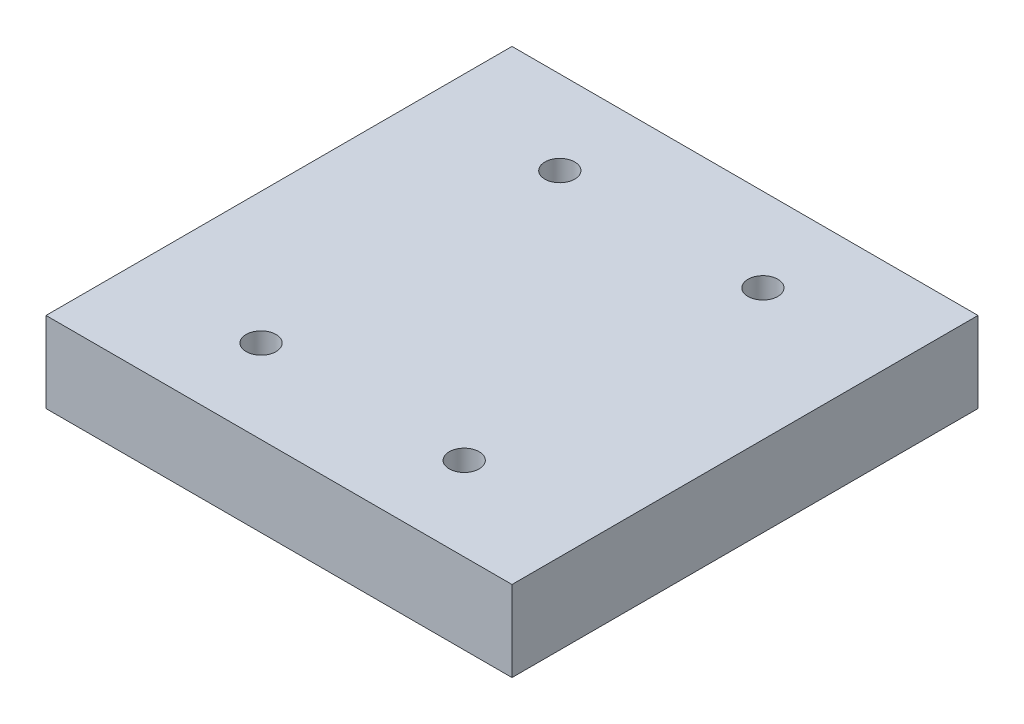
from build123d import *

# Parameters (mm, degrees)
ESBO_O1_W       = 156
ESBO_O1_H       = 156
EXTRUS_O1_DEPTH = 27
ESBO_O2_R       = 5
EXTRUS_O2_DEPTH = 114.564959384


with BuildPart() as part:
    # Esbo_o1 → Extrus_o1 (new body)
    with BuildSketch(Plane(origin=(0, 0, 0), x_dir=(1, 0, 0), z_dir=(0, 1, 0))):
        Rectangle(ESBO_O1_W, ESBO_O1_H)
    extrude(amount=EXTRUS_O1_DEPTH)

    # Esbo_o2 → Extrus_o2 (cut, through all)
    with BuildSketch(Plane.XZ):
        with Locations(Location((34, 50, 0), (0, 0, 270))):
            Circle(ESBO_O2_R)
        with Locations(Location((-34, 50, 0), (0, 0, 270))):
            Circle(ESBO_O2_R)
        with Locations(Location((34, -50, 0), (0, 0, 270))):
            Circle(ESBO_O2_R)
        with Locations(Location((-34, -50, 0), (0, 0, 270))):
            Circle(ESBO_O2_R)
    extrude(amount=-EXTRUS_O2_DEPTH, mode=Mode.SUBTRACT)


solid = part.part
